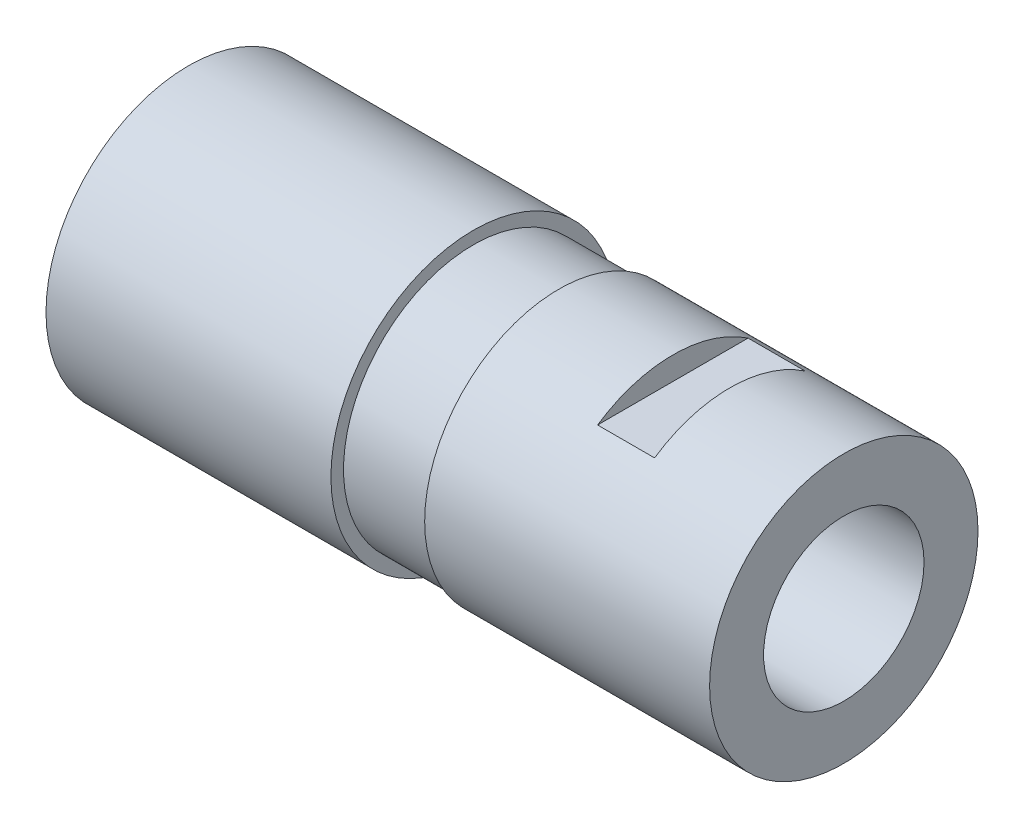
from build123d import *

# Parameters (mm, degrees)
CUT_EXTRUDE1_REACH                  = 32.559
CUT_EXTRUDE1_END_RADIUS             = 5.9817
SKETCH2_W                           = 2.54
SKETCH2_H                           = 1.0287
CUT_EXTRUDE1_DIRECTION_2_REACH      = 32.559
CUT_EXTRUDE1_DIRECTION_2_END_RADIUS = 5.9817


with BuildPart() as part:
    # Sketch1 → Revolve1 (revolve)
    with BuildSketch(Plane.XY, mode=Mode.PRIVATE) as revolve1_sk:
        Polygon((0, 3.57632), (0, 5.9817), (-12.7, 5.9817), (-12.7, 5.788547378), (-16.51, 5.788547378), (-16.51, 6.35), (-29.21, 6.35), (-29.21, 3.175), (-11.1125, 3.175), (-11.1125, 3.57632), align=None)
    revolve(revolve1_sk.sketch.rotate(Axis((2.579980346, 0, 0), (-1, 0, 0)), 90), axis=Axis((2.579980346, 0, 0), (-1, 0, 0)))

    # Cut-Extrude1: up to this cylinder (the profile starts inside it)
    cut_extrude1_end = Plane(origin=(-6.35, 0, 0), z_dir=(1, 0, 0)) * Cylinder(CUT_EXTRUDE1_END_RADIUS, 78.0814, mode=Mode.PRIVATE)
    # Sketch2 → Cut-Extrude1 (cut, up to the surface)
    with BuildSketch(Plane.XY, mode=Mode.PRIVATE) as cut_extrude1_sk1:
        with Locations((-6.35, 5.46735)):
            Rectangle(SKETCH2_W, SKETCH2_H)
    cut_extrude1_tool1 = extrude(cut_extrude1_sk1.sketch, amount=-CUT_EXTRUDE1_REACH, mode=Mode.PRIVATE) & cut_extrude1_end
    add(cut_extrude1_tool1.solids().sort_by_distance((-6.35, 5.46735, 0))[0], mode=Mode.SUBTRACT)
    # Sketch2 → Cut-Extrude1 (cut, up to the surface)
    with BuildSketch(Plane.XY, mode=Mode.PRIVATE) as cut_extrude1_sk2:
        with Locations((-6.35, -5.46735)):
            Rectangle(SKETCH2_W, SKETCH2_H)
    cut_extrude1_tool2 = extrude(cut_extrude1_sk2.sketch, amount=-CUT_EXTRUDE1_REACH, mode=Mode.PRIVATE) & cut_extrude1_end
    add(cut_extrude1_tool2.solids().sort_by_distance((-6.35, -5.46735, 0))[0], mode=Mode.SUBTRACT)

    # Cut-Extrude1 direction 2: up to this cylinder (the profile starts inside it)
    cut_extrude1_direction_2_end = Plane(origin=(-6.35, 0, 0), z_dir=(1, 0, 0)) * Cylinder(CUT_EXTRUDE1_DIRECTION_2_END_RADIUS, 78.0814, mode=Mode.PRIVATE)
    # Sketch2 → Cut-Extrude1 direction 2 (cut, up to the surface)
    with BuildSketch(Plane.XY, mode=Mode.PRIVATE) as cut_extrude1_direction_2_sk1:
        with Locations((-6.35, 5.46735)):
            Rectangle(SKETCH2_W, SKETCH2_H)
    cut_extrude1_direction_2_tool1 = extrude(cut_extrude1_direction_2_sk1.sketch, amount=CUT_EXTRUDE1_DIRECTION_2_REACH, mode=Mode.PRIVATE) & cut_extrude1_direction_2_end
    add(cut_extrude1_direction_2_tool1.solids().sort_by_distance((-6.35, 5.46735, 0))[0], mode=Mode.SUBTRACT)
    # Sketch2 → Cut-Extrude1 direction 2 (cut, up to the surface)
    with BuildSketch(Plane.XY, mode=Mode.PRIVATE) as cut_extrude1_direction_2_sk2:
        with Locations((-6.35, -5.46735)):
            Rectangle(SKETCH2_W, SKETCH2_H)
    cut_extrude1_direction_2_tool2 = extrude(cut_extrude1_direction_2_sk2.sketch, amount=CUT_EXTRUDE1_DIRECTION_2_REACH, mode=Mode.PRIVATE) & cut_extrude1_direction_2_end
    add(cut_extrude1_direction_2_tool2.solids().sort_by_distance((-6.35, -5.46735, 0))[0], mode=Mode.SUBTRACT)


solid = part.part
